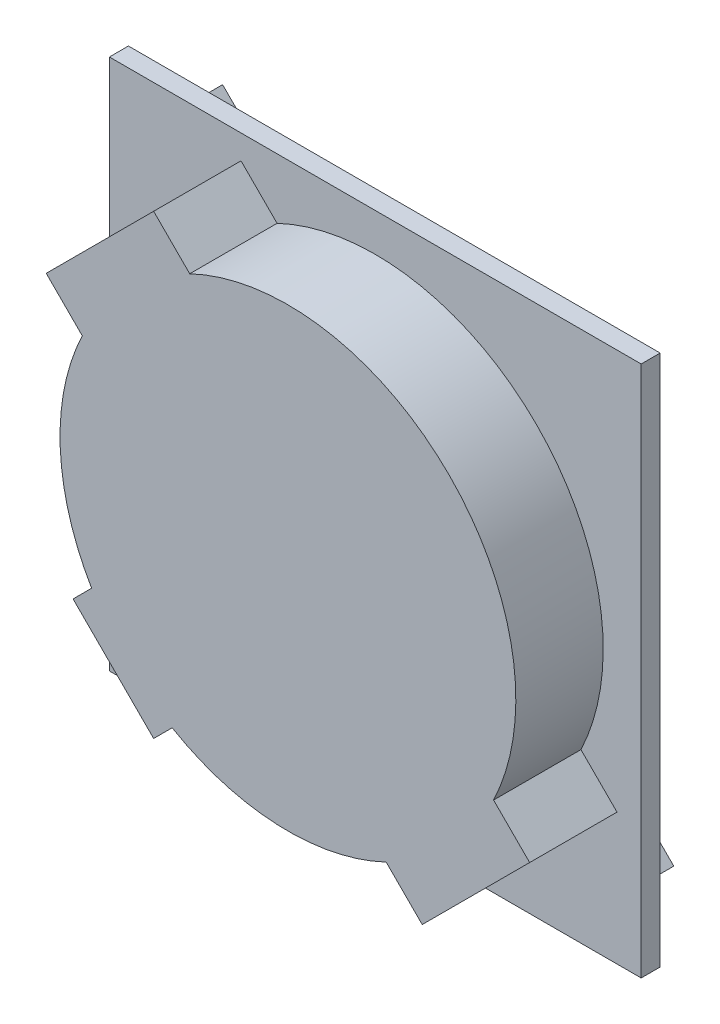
ISO-10303-21;
HEADER;
FILE_DESCRIPTION(('STEP AP214'),'2;1');
FILE_NAME('part.step','',(''),(''),'','','');
FILE_SCHEMA(('AUTOMOTIVE_DESIGN { 1 0 10303 214 1 1 1 1 }'));
ENDSEC;
DATA;
#1=APPLICATION_CONTEXT('core data for automotive mechanical design processes');
#2=APPLICATION_PROTOCOL_DEFINITION('international standard','automotive_design',2000,#1);
#3=PRODUCT_CONTEXT('',#1,'mechanical');
#4=PRODUCT('Part','Part','',(#3));
#5=PRODUCT_RELATED_PRODUCT_CATEGORY('part','',(#4));
#6=PRODUCT_DEFINITION_FORMATION('','',#4);
#7=PRODUCT_DEFINITION_CONTEXT('part definition',#1,'design');
#8=PRODUCT_DEFINITION('design','',#6,#7);
#9=PRODUCT_DEFINITION_SHAPE('','',#8);
#10=(LENGTH_UNIT() NAMED_UNIT(*) SI_UNIT(.MILLI.,.METRE.));
#11=(NAMED_UNIT(*) PLANE_ANGLE_UNIT() SI_UNIT($,.RADIAN.));
#12=(NAMED_UNIT(*) SI_UNIT($,.STERADIAN.) SOLID_ANGLE_UNIT());
#13=UNCERTAINTY_MEASURE_WITH_UNIT(LENGTH_MEASURE(1.E-05),#10,'distance_accuracy_value','');
#14=(GEOMETRIC_REPRESENTATION_CONTEXT(3) GLOBAL_UNCERTAINTY_ASSIGNED_CONTEXT((#13)) GLOBAL_UNIT_ASSIGNED_CONTEXT((#10,
#11,#12)) REPRESENTATION_CONTEXT('',''));
#15=CARTESIAN_POINT('',(0.,0.,0.));
#16=DIRECTION('',(0.,0.,1.));
#17=DIRECTION('',(1.,0.,0.));
#18=AXIS2_PLACEMENT_3D('',#15,#16,#17);
#19=CARTESIAN_POINT('',(0.,0.,0.));
#20=DIRECTION('',(0.,0.,-1.));
#21=DIRECTION('',(-1.,0.,0.));
#22=AXIS2_PLACEMENT_3D('',#19,#20,#21);
#23=PLANE('',#22);
#24=DIRECTION('',(0.707106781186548,-0.707106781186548,0.));
#25=VECTOR('',#24,1.);
#26=CARTESIAN_POINT('',(4.87867965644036,12.6568542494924,0.));
#27=LINE('',#26,#25);
#28=CARTESIAN_POINT('',(5.5857864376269,11.9497474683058,0.));
#29=VERTEX_POINT('',#28);
#30=CARTESIAN_POINT('',(7.70710678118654,9.8284271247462,0.));
#31=VERTEX_POINT('',#30);
#32=EDGE_CURVE('E410',#29,#31,#27,.T.);
#33=ORIENTED_EDGE('',*,*,#32,.F.);
#34=DIRECTION('',(1.,0.,0.));
#35=VECTOR('',#34,1.);
#36=CARTESIAN_POINT('',(5.5857864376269,11.9497474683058,0.));
#37=LINE('',#36,#35);
#38=CARTESIAN_POINT('',(4.17157287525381,11.9497474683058,0.));
#39=VERTEX_POINT('',#38);
#40=EDGE_CURVE('E663',#29,#39,#37,.F.);
#41=ORIENTED_EDGE('',*,*,#40,.T.);
#42=DIRECTION('',(0.707106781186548,0.707106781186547,0.));
#43=VECTOR('',#42,1.);
#44=CARTESIAN_POINT('',(1.34314575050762,9.12132034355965,0.));
#45=LINE('',#44,#43);
#46=CARTESIAN_POINT('',(2.05025253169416,9.82842712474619,0.));
#47=VERTEX_POINT('',#46);
#48=EDGE_CURVE('E417',#47,#39,#45,.T.);
#49=ORIENTED_EDGE('',*,*,#48,.F.);
#50=DIRECTION('',(0.,1.,0.));
#51=VECTOR('',#50,1.);
#52=CARTESIAN_POINT('',(2.05025253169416,9.82842712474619,0.));
#53=LINE('',#52,#51);
#54=CARTESIAN_POINT('',(2.05025253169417,8.4142135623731,0.));
#55=VERTEX_POINT('',#54);
#56=EDGE_CURVE('E661',#47,#55,#53,.F.);
#57=ORIENTED_EDGE('',*,*,#56,.T.);
#58=DIRECTION('',(-0.707106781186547,0.707106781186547,0.));
#59=VECTOR('',#58,1.);
#60=CARTESIAN_POINT('',(1.34314575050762,9.12132034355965,0.));
#61=LINE('',#60,#59);
#62=CARTESIAN_POINT('',(4.1715728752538,6.29289321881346,0.));
#63=VERTEX_POINT('',#62);
#64=EDGE_CURVE('E437',#63,#55,#61,.T.);
#65=ORIENTED_EDGE('',*,*,#64,.F.);
#66=DIRECTION('',(-1.,0.,0.));
#67=VECTOR('',#66,1.);
#68=CARTESIAN_POINT('',(4.1715728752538,6.29289321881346,0.));
#69=LINE('',#68,#67);
#70=CARTESIAN_POINT('',(5.5857864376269,6.29289321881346,0.));
#71=VERTEX_POINT('',#70);
#72=EDGE_CURVE('E658',#63,#71,#69,.F.);
#73=ORIENTED_EDGE('',*,*,#72,.T.);
#74=DIRECTION('',(-0.707106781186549,-0.707106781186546,0.));
#75=VECTOR('',#74,1.);
#76=CARTESIAN_POINT('',(8.41421356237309,9.12132034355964,0.));
#77=LINE('',#76,#75);
#78=CARTESIAN_POINT('',(7.70710678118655,8.4142135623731,0.));
#79=VERTEX_POINT('',#78);
#80=EDGE_CURVE('E433',#79,#71,#77,.T.);
#81=ORIENTED_EDGE('',*,*,#80,.F.);
#82=DIRECTION('',(0.,-1.,0.));
#83=VECTOR('',#82,1.);
#84=CARTESIAN_POINT('',(7.70710678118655,8.4142135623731,0.));
#85=LINE('',#84,#83);
#86=EDGE_CURVE('E60',#79,#31,#85,.F.);
#87=ORIENTED_EDGE('',*,*,#86,.T.);
#88=EDGE_LOOP('',(#33,#41,#49,#57,#65,#73,#81,#87));
#89=FACE_BOUND('',#88,.T.);
#90=DIRECTION('',(0.,-1.,0.));
#91=VECTOR('',#90,1.);
#92=CARTESIAN_POINT('',(0.,0.,0.));
#93=LINE('',#92,#91);
#94=CARTESIAN_POINT('',(0.,14.,0.));
#95=VERTEX_POINT('',#94);
#96=CARTESIAN_POINT('',(0.,0.,0.));
#97=VERTEX_POINT('',#96);
#98=EDGE_CURVE('E576',#95,#97,#93,.T.);
#99=ORIENTED_EDGE('',*,*,#98,.F.);
#100=DIRECTION('',(-1.,0.,0.));
#101=VECTOR('',#100,1.);
#102=CARTESIAN_POINT('',(0.,14.,0.));
#103=LINE('',#102,#101);
#104=CARTESIAN_POINT('',(14.,14.,0.));
#105=VERTEX_POINT('',#104);
#106=EDGE_CURVE('E582',#105,#95,#103,.T.);
#107=ORIENTED_EDGE('',*,*,#106,.F.);
#108=DIRECTION('',(0.,1.,0.));
#109=VECTOR('',#108,1.);
#110=CARTESIAN_POINT('',(14.,0.,0.));
#111=LINE('',#110,#109);
#112=CARTESIAN_POINT('',(14.,0.,0.));
#113=VERTEX_POINT('',#112);
#114=EDGE_CURVE('E598',#113,#105,#111,.T.);
#115=ORIENTED_EDGE('',*,*,#114,.F.);
#116=DIRECTION('',(1.,0.,0.));
#117=VECTOR('',#116,1.);
#118=CARTESIAN_POINT('',(0.,0.,0.));
#119=LINE('',#118,#117);
#120=EDGE_CURVE('E595',#97,#113,#119,.T.);
#121=ORIENTED_EDGE('',*,*,#120,.F.);
#122=EDGE_LOOP('',(#99,#107,#115,#121));
#123=FACE_BOUND('',#122,.T.);
#124=DIRECTION('',(-0.707106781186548,-0.707106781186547,0.));
#125=VECTOR('',#124,1.);
#126=CARTESIAN_POINT('',(2.54558441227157,13.2928932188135,0.));
#127=LINE('',#126,#125);
#128=CARTESIAN_POINT('',(2.54558441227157,13.2928932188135,0.));
#129=VERTEX_POINT('',#128);
#130=CARTESIAN_POINT('',(0.707106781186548,11.4544155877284,0.));
#131=VERTEX_POINT('',#130);
#132=EDGE_CURVE('E385',#129,#131,#127,.T.);
#133=ORIENTED_EDGE('',*,*,#132,.F.);
#134=DIRECTION('',(0.707106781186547,-0.707106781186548,0.));
#135=VECTOR('',#134,1.);
#136=CARTESIAN_POINT('',(1.97989898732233,13.8585786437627,0.));
#137=LINE('',#136,#135);
#138=CARTESIAN_POINT('',(1.97989898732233,13.8585786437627,0.));
#139=VERTEX_POINT('',#138);
#140=EDGE_CURVE('E366',#139,#129,#137,.T.);
#141=ORIENTED_EDGE('',*,*,#140,.F.);
#142=DIRECTION('',(0.707106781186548,0.707106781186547,0.));
#143=VECTOR('',#142,1.);
#144=CARTESIAN_POINT('',(0.14142135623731,12.0201010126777,0.));
#145=LINE('',#144,#143);
#146=CARTESIAN_POINT('',(0.141421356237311,12.0201010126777,0.));
#147=VERTEX_POINT('',#146);
#148=EDGE_CURVE('E372',#147,#139,#145,.T.);
#149=ORIENTED_EDGE('',*,*,#148,.F.);
#150=DIRECTION('',(-0.707106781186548,0.707106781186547,0.));
#151=VECTOR('',#150,1.);
#152=CARTESIAN_POINT('',(0.14142135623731,12.0201010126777,0.));
#153=LINE('',#152,#151);
#154=EDGE_CURVE('E388',#131,#147,#153,.T.);
#155=ORIENTED_EDGE('',*,*,#154,.F.);
#156=EDGE_LOOP('',(#133,#141,#149,#155));
#157=FACE_BOUND('',#156,.T.);
#158=DIRECTION('',(0.70710678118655,-0.707106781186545,0.));
#159=VECTOR('',#158,1.);
#160=CARTESIAN_POINT('',(0.707106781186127,2.54558441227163,0.));
#161=LINE('',#160,#159);
#162=CARTESIAN_POINT('',(0.707106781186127,2.54558441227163,0.));
#163=VERTEX_POINT('',#162);
#164=CARTESIAN_POINT('',(2.54558441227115,0.707106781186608,0.));
#165=VERTEX_POINT('',#164);
#166=EDGE_CURVE('E327',#163,#165,#161,.T.);
#167=ORIENTED_EDGE('',*,*,#166,.F.);
#168=DIRECTION('',(0.707106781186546,0.707106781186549,0.));
#169=VECTOR('',#168,1.);
#170=CARTESIAN_POINT('',(0.14142135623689,1.97989898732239,0.));
#171=LINE('',#170,#169);
#172=CARTESIAN_POINT('',(0.14142135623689,1.97989898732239,0.));
#173=VERTEX_POINT('',#172);
#174=EDGE_CURVE('E320',#173,#163,#171,.T.);
#175=ORIENTED_EDGE('',*,*,#174,.F.);
#176=DIRECTION('',(-0.70710678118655,0.707106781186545,0.));
#177=VECTOR('',#176,1.);
#178=CARTESIAN_POINT('',(1.97989898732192,0.141421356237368,0.));
#179=LINE('',#178,#177);
#180=CARTESIAN_POINT('',(1.97989898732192,0.141421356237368,0.));
#181=VERTEX_POINT('',#180);
#182=EDGE_CURVE('E337',#181,#173,#179,.T.);
#183=ORIENTED_EDGE('',*,*,#182,.F.);
#184=DIRECTION('',(-0.707106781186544,-0.707106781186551,0.));
#185=VECTOR('',#184,1.);
#186=CARTESIAN_POINT('',(1.97989898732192,0.141421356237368,0.));
#187=LINE('',#186,#185);
#188=EDGE_CURVE('E349',#165,#181,#187,.T.);
#189=ORIENTED_EDGE('',*,*,#188,.F.);
#190=EDGE_LOOP('',(#167,#175,#183,#189));
#191=FACE_BOUND('',#190,.T.);
#192=DIRECTION('',(0.707106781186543,0.707106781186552,0.));
#193=VECTOR('',#192,1.);
#194=CARTESIAN_POINT('',(11.454415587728,0.707106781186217,0.));
#195=LINE('',#194,#193);
#196=CARTESIAN_POINT('',(11.454415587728,0.707106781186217,0.));
#197=VERTEX_POINT('',#196);
#198=CARTESIAN_POINT('',(13.292893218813,2.54558441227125,0.));
#199=VERTEX_POINT('',#198);
#200=EDGE_CURVE('E1295',#197,#199,#195,.T.);
#201=ORIENTED_EDGE('',*,*,#200,.F.);
#202=DIRECTION('',(-0.707106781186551,0.707106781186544,0.));
#203=VECTOR('',#202,1.);
#204=CARTESIAN_POINT('',(12.0201010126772,0.141421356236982,0.));
#205=LINE('',#204,#203);
#206=CARTESIAN_POINT('',(12.0201010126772,0.141421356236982,0.));
#207=VERTEX_POINT('',#206);
#208=EDGE_CURVE('E317',#207,#197,#205,.T.);
#209=ORIENTED_EDGE('',*,*,#208,.F.);
#210=DIRECTION('',(-0.707106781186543,-0.707106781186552,0.));
#211=VECTOR('',#210,1.);
#212=CARTESIAN_POINT('',(13.8585786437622,1.97989898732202,0.));
#213=LINE('',#212,#211);
#214=CARTESIAN_POINT('',(13.8585786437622,1.97989898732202,0.));
#215=VERTEX_POINT('',#214);
#216=EDGE_CURVE('E313',#215,#207,#213,.T.);
#217=ORIENTED_EDGE('',*,*,#216,.F.);
#218=DIRECTION('',(0.707106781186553,-0.707106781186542,0.));
#219=VECTOR('',#218,1.);
#220=CARTESIAN_POINT('',(13.8585786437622,1.97989898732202,0.));
#221=LINE('',#220,#219);
#222=EDGE_CURVE('E1291',#199,#215,#221,.T.);
#223=ORIENTED_EDGE('',*,*,#222,.F.);
#224=EDGE_LOOP('',(#201,#209,#217,#223));
#225=FACE_BOUND('',#224,.T.);
#226=ADVANCED_FACE('F55',(#89,#123,#157,#191,#225),#23,.T.);
#227=CARTESIAN_POINT('',(0.,0.,0.5));
#228=DIRECTION('',(0.,0.,-1.));
#229=DIRECTION('',(-1.,0.,0.));
#230=AXIS2_PLACEMENT_3D('',#227,#228,#229);
#231=PLANE('',#230);
#232=DIRECTION('',(0.,-1.,0.));
#233=VECTOR('',#232,1.);
#234=CARTESIAN_POINT('',(0.,0.,0.5));
#235=LINE('',#234,#233);
#236=CARTESIAN_POINT('',(0.,14.,0.5));
#237=VERTEX_POINT('',#236);
#238=CARTESIAN_POINT('',(0.,0.,0.5));
#239=VERTEX_POINT('',#238);
#240=EDGE_CURVE('E577',#237,#239,#235,.T.);
#241=ORIENTED_EDGE('',*,*,#240,.T.);
#242=DIRECTION('',(1.,0.,0.));
#243=VECTOR('',#242,1.);
#244=CARTESIAN_POINT('',(0.,0.,0.5));
#245=LINE('',#244,#243);
#246=CARTESIAN_POINT('',(14.,0.,0.5));
#247=VERTEX_POINT('',#246);
#248=EDGE_CURVE('E581',#239,#247,#245,.T.);
#249=ORIENTED_EDGE('',*,*,#248,.T.);
#250=DIRECTION('',(0.,1.,0.));
#251=VECTOR('',#250,1.);
#252=CARTESIAN_POINT('',(14.,0.,0.5));
#253=LINE('',#252,#251);
#254=CARTESIAN_POINT('',(14.,14.,0.5));
#255=VERTEX_POINT('',#254);
#256=EDGE_CURVE('E585',#247,#255,#253,.T.);
#257=ORIENTED_EDGE('',*,*,#256,.T.);
#258=DIRECTION('',(-1.,0.,0.));
#259=VECTOR('',#258,1.);
#260=CARTESIAN_POINT('',(0.,14.,0.5));
#261=LINE('',#260,#259);
#262=EDGE_CURVE('E588',#255,#237,#261,.T.);
#263=ORIENTED_EDGE('',*,*,#262,.T.);
#264=EDGE_LOOP('',(#241,#249,#257,#263));
#265=FACE_BOUND('',#264,.T.);
#266=CARTESIAN_POINT('',(7.,7.,0.5));
#267=DIRECTION('',(0.,0.,1.));
#268=DIRECTION('',(1.,0.,0.));
#269=AXIS2_PLACEMENT_3D('',#266,#267,#268);
#270=CIRCLE('',#269,6.);
#271=CARTESIAN_POINT('',(3.95274099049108,1.83142064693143,0.5));
#272=VERTEX_POINT('',#271);
#273=CARTESIAN_POINT('',(9.58578643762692,1.58578643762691,0.5));
#274=VERTEX_POINT('',#273);
#275=EDGE_CURVE('E429',#272,#274,#270,.T.);
#276=ORIENTED_EDGE('',*,*,#275,.F.);
#277=DIRECTION('',(0.707106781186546,0.707106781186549,0.));
#278=VECTOR('',#277,1.);
#279=CARTESIAN_POINT('',(3.95274099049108,1.83142064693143,0.5));
#280=LINE('',#279,#278);
#281=CARTESIAN_POINT('',(3.46446609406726,1.34314575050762,0.5));
#282=VERTEX_POINT('',#281);
#283=EDGE_CURVE('E449',#282,#272,#280,.T.);
#284=ORIENTED_EDGE('',*,*,#283,.F.);
#285=DIRECTION('',(0.707106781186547,-0.707106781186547,0.));
#286=VECTOR('',#285,1.);
#287=CARTESIAN_POINT('',(1.34314575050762,3.46446609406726,0.5));
#288=LINE('',#287,#286);
#289=CARTESIAN_POINT('',(1.34314575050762,3.46446609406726,0.5));
#290=VERTEX_POINT('',#289);
#291=EDGE_CURVE('E522',#290,#282,#288,.T.);
#292=ORIENTED_EDGE('',*,*,#291,.F.);
#293=DIRECTION('',(-0.707106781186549,-0.707106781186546,0.));
#294=VECTOR('',#293,1.);
#295=CARTESIAN_POINT('',(1.83142064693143,3.95274099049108,0.5));
#296=LINE('',#295,#294);
#297=CARTESIAN_POINT('',(1.83142064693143,3.95274099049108,0.5));
#298=VERTEX_POINT('',#297);
#299=EDGE_CURVE('E518',#298,#290,#296,.T.);
#300=ORIENTED_EDGE('',*,*,#299,.F.);
#301=CARTESIAN_POINT('',(7.,7.,0.5));
#302=DIRECTION('',(0.,0.,1.));
#303=DIRECTION('',(1.,0.,0.));
#304=AXIS2_PLACEMENT_3D('',#301,#302,#303);
#305=CIRCLE('',#304,6.);
#306=CARTESIAN_POINT('',(1.58578643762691,9.58578643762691,0.5));
#307=VERTEX_POINT('',#306);
#308=EDGE_CURVE('E514',#307,#298,#305,.T.);
#309=ORIENTED_EDGE('',*,*,#308,.F.);
#310=DIRECTION('',(0.707106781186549,-0.707106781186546,0.));
#311=VECTOR('',#310,1.);
#312=CARTESIAN_POINT('',(0.63603896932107,10.5355339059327,0.5));
#313=LINE('',#312,#311);
#314=CARTESIAN_POINT('',(0.63603896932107,10.5355339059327,0.5));
#315=VERTEX_POINT('',#314);
#316=EDGE_CURVE('E510',#315,#307,#313,.T.);
#317=ORIENTED_EDGE('',*,*,#316,.F.);
#318=DIRECTION('',(-0.707106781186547,-0.707106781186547,0.));
#319=VECTOR('',#318,1.);
#320=CARTESIAN_POINT('',(3.46446609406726,13.3639610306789,0.5));
#321=LINE('',#320,#319);
#322=CARTESIAN_POINT('',(3.46446609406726,13.3639610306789,0.5));
#323=VERTEX_POINT('',#322);
#324=EDGE_CURVE('E506',#323,#315,#321,.T.);
#325=ORIENTED_EDGE('',*,*,#324,.F.);
#326=DIRECTION('',(-0.707106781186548,0.707106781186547,0.));
#327=VECTOR('',#326,1.);
#328=CARTESIAN_POINT('',(3.46446609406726,13.3639610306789,0.5));
#329=LINE('',#328,#327);
#330=CARTESIAN_POINT('',(4.41421356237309,12.4142135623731,0.5));
#331=VERTEX_POINT('',#330);
#332=EDGE_CURVE('E502',#331,#323,#329,.T.);
#333=ORIENTED_EDGE('',*,*,#332,.F.);
#334=CARTESIAN_POINT('',(7.,7.,0.5));
#335=DIRECTION('',(0.,0.,1.));
#336=DIRECTION('',(1.,0.,0.));
#337=AXIS2_PLACEMENT_3D('',#334,#335,#336);
#338=CIRCLE('',#337,6.);
#339=CARTESIAN_POINT('',(12.4142135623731,4.4142135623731,0.5));
#340=VERTEX_POINT('',#339);
#341=EDGE_CURVE('E498',#340,#331,#338,.T.);
#342=ORIENTED_EDGE('',*,*,#341,.F.);
#343=DIRECTION('',(-0.707106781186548,0.707106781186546,0.));
#344=VECTOR('',#343,1.);
#345=CARTESIAN_POINT('',(12.4142135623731,4.4142135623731,0.5));
#346=LINE('',#345,#344);
#347=CARTESIAN_POINT('',(13.3639610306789,3.46446609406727,0.5));
#348=VERTEX_POINT('',#347);
#349=EDGE_CURVE('E494',#348,#340,#346,.T.);
#350=ORIENTED_EDGE('',*,*,#349,.F.);
#351=DIRECTION('',(0.707106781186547,0.707106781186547,0.));
#352=VECTOR('',#351,1.);
#353=CARTESIAN_POINT('',(13.3639610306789,3.46446609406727,0.5));
#354=LINE('',#353,#352);
#355=CARTESIAN_POINT('',(10.5355339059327,0.636038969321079,0.5));
#356=VERTEX_POINT('',#355);
#357=EDGE_CURVE('E490',#356,#348,#354,.T.);
#358=ORIENTED_EDGE('',*,*,#357,.F.);
#359=DIRECTION('',(0.707106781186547,-0.707106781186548,0.));
#360=VECTOR('',#359,1.);
#361=CARTESIAN_POINT('',(9.58578643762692,1.58578643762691,0.5));
#362=LINE('',#361,#360);
#363=EDGE_CURVE('E486',#274,#356,#362,.T.);
#364=ORIENTED_EDGE('',*,*,#363,.F.);
#365=EDGE_LOOP('',(#276,#284,#292,#300,#309,#317,#325,#333,#342,#350,#358,#364));
#366=FACE_BOUND('',#365,.T.);
#367=ADVANCED_FACE('F718',(#265,#366),#231,.F.);
#368=CARTESIAN_POINT('',(0.,0.,0.5));
#369=DIRECTION('',(1.,0.,0.));
#370=DIRECTION('',(0.,0.,-1.));
#371=AXIS2_PLACEMENT_3D('',#368,#369,#370);
#372=PLANE('',#371);
#373=ORIENTED_EDGE('',*,*,#98,.T.);
#374=DIRECTION('',(0.,0.,-1.));
#375=VECTOR('',#374,1.);
#376=CARTESIAN_POINT('',(0.,0.,0.5));
#377=LINE('',#376,#375);
#378=EDGE_CURVE('E614',#239,#97,#377,.T.);
#379=ORIENTED_EDGE('',*,*,#378,.F.);
#380=ORIENTED_EDGE('',*,*,#240,.F.);
#381=DIRECTION('',(0.,0.,-1.));
#382=VECTOR('',#381,1.);
#383=CARTESIAN_POINT('',(0.,14.,0.5));
#384=LINE('',#383,#382);
#385=EDGE_CURVE('E591',#237,#95,#384,.T.);
#386=ORIENTED_EDGE('',*,*,#385,.T.);
#387=EDGE_LOOP('',(#373,#379,#380,#386));
#388=FACE_BOUND('',#387,.T.);
#389=ADVANCED_FACE('F723',(#388),#372,.F.);
#390=CARTESIAN_POINT('',(0.,0.,0.5));
#391=DIRECTION('',(0.,1.,0.));
#392=DIRECTION('',(0.,0.,1.));
#393=AXIS2_PLACEMENT_3D('',#390,#391,#392);
#394=PLANE('',#393);
#395=ORIENTED_EDGE('',*,*,#120,.T.);
#396=DIRECTION('',(0.,0.,-1.));
#397=VECTOR('',#396,1.);
#398=CARTESIAN_POINT('',(14.,0.,0.5));
#399=LINE('',#398,#397);
#400=EDGE_CURVE('E610',#247,#113,#399,.T.);
#401=ORIENTED_EDGE('',*,*,#400,.F.);
#402=ORIENTED_EDGE('',*,*,#248,.F.);
#403=ORIENTED_EDGE('',*,*,#378,.T.);
#404=EDGE_LOOP('',(#395,#401,#402,#403));
#405=FACE_BOUND('',#404,.T.);
#406=ADVANCED_FACE('F736',(#405),#394,.F.);
#407=CARTESIAN_POINT('',(14.,0.,0.5));
#408=DIRECTION('',(-1.,0.,0.));
#409=DIRECTION('',(0.,0.,1.));
#410=AXIS2_PLACEMENT_3D('',#407,#408,#409);
#411=PLANE('',#410);
#412=ORIENTED_EDGE('',*,*,#114,.T.);
#413=DIRECTION('',(0.,0.,-1.));
#414=VECTOR('',#413,1.);
#415=CARTESIAN_POINT('',(14.,14.,0.5));
#416=LINE('',#415,#414);
#417=EDGE_CURVE('E606',#255,#105,#416,.T.);
#418=ORIENTED_EDGE('',*,*,#417,.F.);
#419=ORIENTED_EDGE('',*,*,#256,.F.);
#420=ORIENTED_EDGE('',*,*,#400,.T.);
#421=EDGE_LOOP('',(#412,#418,#419,#420));
#422=FACE_BOUND('',#421,.T.);
#423=ADVANCED_FACE('F732',(#422),#411,.F.);
#424=CARTESIAN_POINT('',(0.,14.,0.5));
#425=DIRECTION('',(0.,-1.,0.));
#426=DIRECTION('',(0.,0.,-1.));
#427=AXIS2_PLACEMENT_3D('',#424,#425,#426);
#428=PLANE('',#427);
#429=ORIENTED_EDGE('',*,*,#106,.T.);
#430=ORIENTED_EDGE('',*,*,#385,.F.);
#431=ORIENTED_EDGE('',*,*,#262,.F.);
#432=ORIENTED_EDGE('',*,*,#417,.T.);
#433=EDGE_LOOP('',(#429,#430,#431,#432));
#434=FACE_BOUND('',#433,.T.);
#435=ADVANCED_FACE('F728',(#434),#428,.F.);
#436=CARTESIAN_POINT('',(7.,7.,2.8));
#437=DIRECTION('',(0.,0.,-1.));
#438=DIRECTION('',(-1.,0.,0.));
#439=AXIS2_PLACEMENT_3D('',#436,#437,#438);
#440=CYLINDRICAL_SURFACE('',#439,6.);
#441=ORIENTED_EDGE('',*,*,#275,.T.);
#442=DIRECTION('',(0.,0.,-1.));
#443=VECTOR('',#442,1.);
#444=CARTESIAN_POINT('',(9.58578643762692,1.58578643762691,2.8));
#445=LINE('',#444,#443);
#446=CARTESIAN_POINT('',(9.58578643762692,1.58578643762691,2.8));
#447=VERTEX_POINT('',#446);
#448=EDGE_CURVE('E572',#447,#274,#445,.T.);
#449=ORIENTED_EDGE('',*,*,#448,.F.);
#450=CARTESIAN_POINT('',(7.,7.,2.8));
#451=DIRECTION('',(0.,0.,1.));
#452=DIRECTION('',(1.,0.,0.));
#453=AXIS2_PLACEMENT_3D('',#450,#451,#452);
#454=CIRCLE('',#453,6.);
#455=CARTESIAN_POINT('',(3.95274099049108,1.83142064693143,2.8));
#456=VERTEX_POINT('',#455);
#457=EDGE_CURVE('E444',#456,#447,#454,.T.);
#458=ORIENTED_EDGE('',*,*,#457,.F.);
#459=DIRECTION('',(0.,0.,-1.));
#460=VECTOR('',#459,1.);
#461=CARTESIAN_POINT('',(3.95274099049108,1.83142064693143,2.8));
#462=LINE('',#461,#460);
#463=EDGE_CURVE('E482',#456,#272,#462,.T.);
#464=ORIENTED_EDGE('',*,*,#463,.T.);
#465=EDGE_LOOP('',(#441,#449,#458,#464));
#466=FACE_BOUND('',#465,.T.);
#467=ADVANCED_FACE('F731',(#466),#440,.T.);
#468=CARTESIAN_POINT('',(9.58578643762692,1.58578643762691,2.8));
#469=DIRECTION('',(0.707106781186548,0.707106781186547,0.));
#470=DIRECTION('',(-0.707106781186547,0.707106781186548,0.));
#471=AXIS2_PLACEMENT_3D('',#468,#469,#470);
#472=PLANE('',#471);
#473=ORIENTED_EDGE('',*,*,#363,.T.);
#474=DIRECTION('',(0.,0.,-1.));
#475=VECTOR('',#474,1.);
#476=CARTESIAN_POINT('',(10.5355339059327,0.636038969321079,2.8));
#477=LINE('',#476,#475);
#478=CARTESIAN_POINT('',(10.5355339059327,0.636038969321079,2.8));
#479=VERTEX_POINT('',#478);
#480=EDGE_CURVE('E568',#479,#356,#477,.T.);
#481=ORIENTED_EDGE('',*,*,#480,.F.);
#482=DIRECTION('',(0.707106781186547,-0.707106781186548,0.));
#483=VECTOR('',#482,1.);
#484=CARTESIAN_POINT('',(9.58578643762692,1.58578643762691,2.8));
#485=LINE('',#484,#483);
#486=EDGE_CURVE('E448',#447,#479,#485,.T.);
#487=ORIENTED_EDGE('',*,*,#486,.F.);
#488=ORIENTED_EDGE('',*,*,#448,.T.);
#489=EDGE_LOOP('',(#473,#481,#487,#488));
#490=FACE_BOUND('',#489,.T.);
#491=ADVANCED_FACE('F817',(#490),#472,.F.);
#492=CARTESIAN_POINT('',(13.3639610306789,3.46446609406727,2.8));
#493=DIRECTION('',(-0.707106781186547,0.707106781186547,0.));
#494=DIRECTION('',(-0.707106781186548,-0.707106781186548,0.));
#495=AXIS2_PLACEMENT_3D('',#492,#493,#494);
#496=PLANE('',#495);
#497=ORIENTED_EDGE('',*,*,#357,.T.);
#498=DIRECTION('',(0.,0.,-1.));
#499=VECTOR('',#498,1.);
#500=CARTESIAN_POINT('',(13.3639610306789,3.46446609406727,2.8));
#501=LINE('',#500,#499);
#502=CARTESIAN_POINT('',(13.3639610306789,3.46446609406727,2.8));
#503=VERTEX_POINT('',#502);
#504=EDGE_CURVE('E564',#503,#348,#501,.T.);
#505=ORIENTED_EDGE('',*,*,#504,.F.);
#506=DIRECTION('',(0.707106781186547,0.707106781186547,0.));
#507=VECTOR('',#506,1.);
#508=CARTESIAN_POINT('',(13.3639610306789,3.46446609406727,2.8));
#509=LINE('',#508,#507);
#510=EDGE_CURVE('E452',#479,#503,#509,.T.);
#511=ORIENTED_EDGE('',*,*,#510,.F.);
#512=ORIENTED_EDGE('',*,*,#480,.T.);
#513=EDGE_LOOP('',(#497,#505,#511,#512));
#514=FACE_BOUND('',#513,.T.);
#515=ADVANCED_FACE('F813',(#514),#496,.F.);
#516=CARTESIAN_POINT('',(12.4142135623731,4.4142135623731,2.8));
#517=DIRECTION('',(-0.707106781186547,-0.707106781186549,0.));
#518=DIRECTION('',(0.707106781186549,-0.707106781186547,0.));
#519=AXIS2_PLACEMENT_3D('',#516,#517,#518);
#520=PLANE('',#519);
#521=ORIENTED_EDGE('',*,*,#349,.T.);
#522=DIRECTION('',(0.,0.,-1.));
#523=VECTOR('',#522,1.);
#524=CARTESIAN_POINT('',(12.4142135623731,4.4142135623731,2.8));
#525=LINE('',#524,#523);
#526=CARTESIAN_POINT('',(12.4142135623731,4.4142135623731,2.8));
#527=VERTEX_POINT('',#526);
#528=EDGE_CURVE('E560',#527,#340,#525,.T.);
#529=ORIENTED_EDGE('',*,*,#528,.F.);
#530=DIRECTION('',(-0.707106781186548,0.707106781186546,0.));
#531=VECTOR('',#530,1.);
#532=CARTESIAN_POINT('',(12.4142135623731,4.4142135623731,2.8));
#533=LINE('',#532,#531);
#534=EDGE_CURVE('E455',#503,#527,#533,.T.);
#535=ORIENTED_EDGE('',*,*,#534,.F.);
#536=ORIENTED_EDGE('',*,*,#504,.T.);
#537=EDGE_LOOP('',(#521,#529,#535,#536));
#538=FACE_BOUND('',#537,.T.);
#539=ADVANCED_FACE('F809',(#538),#520,.F.);
#540=CARTESIAN_POINT('',(7.,7.,2.8));
#541=DIRECTION('',(0.,0.,-1.));
#542=DIRECTION('',(-1.,0.,0.));
#543=AXIS2_PLACEMENT_3D('',#540,#541,#542);
#544=CYLINDRICAL_SURFACE('',#543,6.);
#545=ORIENTED_EDGE('',*,*,#341,.T.);
#546=DIRECTION('',(0.,0.,-1.));
#547=VECTOR('',#546,1.);
#548=CARTESIAN_POINT('',(4.41421356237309,12.4142135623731,2.8));
#549=LINE('',#548,#547);
#550=CARTESIAN_POINT('',(4.41421356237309,12.4142135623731,2.8));
#551=VERTEX_POINT('',#550);
#552=EDGE_CURVE('E556',#551,#331,#549,.T.);
#553=ORIENTED_EDGE('',*,*,#552,.F.);
#554=CARTESIAN_POINT('',(7.,7.,2.8));
#555=DIRECTION('',(0.,0.,1.));
#556=DIRECTION('',(1.,0.,0.));
#557=AXIS2_PLACEMENT_3D('',#554,#555,#556);
#558=CIRCLE('',#557,6.);
#559=EDGE_CURVE('E458',#527,#551,#558,.T.);
#560=ORIENTED_EDGE('',*,*,#559,.F.);
#561=ORIENTED_EDGE('',*,*,#528,.T.);
#562=EDGE_LOOP('',(#545,#553,#560,#561));
#563=FACE_BOUND('',#562,.T.);
#564=ADVANCED_FACE('F805',(#563),#544,.T.);
#565=CARTESIAN_POINT('',(3.46446609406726,13.3639610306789,2.8));
#566=DIRECTION('',(-0.707106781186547,-0.707106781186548,0.));
#567=DIRECTION('',(0.707106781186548,-0.707106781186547,0.));
#568=AXIS2_PLACEMENT_3D('',#565,#566,#567);
#569=PLANE('',#568);
#570=ORIENTED_EDGE('',*,*,#332,.T.);
#571=DIRECTION('',(0.,0.,-1.));
#572=VECTOR('',#571,1.);
#573=CARTESIAN_POINT('',(3.46446609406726,13.3639610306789,2.8));
#574=LINE('',#573,#572);
#575=CARTESIAN_POINT('',(3.46446609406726,13.3639610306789,2.8));
#576=VERTEX_POINT('',#575);
#577=EDGE_CURVE('E552',#576,#323,#574,.T.);
#578=ORIENTED_EDGE('',*,*,#577,.F.);
#579=DIRECTION('',(-0.707106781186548,0.707106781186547,0.));
#580=VECTOR('',#579,1.);
#581=CARTESIAN_POINT('',(3.46446609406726,13.3639610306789,2.8));
#582=LINE('',#581,#580);
#583=EDGE_CURVE('E461',#551,#576,#582,.T.);
#584=ORIENTED_EDGE('',*,*,#583,.F.);
#585=ORIENTED_EDGE('',*,*,#552,.T.);
#586=EDGE_LOOP('',(#570,#578,#584,#585));
#587=FACE_BOUND('',#586,.T.);
#588=ADVANCED_FACE('F801',(#587),#569,.F.);
#589=CARTESIAN_POINT('',(3.46446609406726,13.3639610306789,2.8));
#590=DIRECTION('',(0.707106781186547,-0.707106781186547,0.));
#591=DIRECTION('',(0.707106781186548,0.707106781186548,0.));
#592=AXIS2_PLACEMENT_3D('',#589,#590,#591);
#593=PLANE('',#592);
#594=ORIENTED_EDGE('',*,*,#324,.T.);
#595=DIRECTION('',(0.,0.,-1.));
#596=VECTOR('',#595,1.);
#597=CARTESIAN_POINT('',(0.63603896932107,10.5355339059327,2.8));
#598=LINE('',#597,#596);
#599=CARTESIAN_POINT('',(0.63603896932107,10.5355339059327,2.8));
#600=VERTEX_POINT('',#599);
#601=EDGE_CURVE('E548',#600,#315,#598,.T.);
#602=ORIENTED_EDGE('',*,*,#601,.F.);
#603=DIRECTION('',(-0.707106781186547,-0.707106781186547,0.));
#604=VECTOR('',#603,1.);
#605=CARTESIAN_POINT('',(3.46446609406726,13.3639610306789,2.8));
#606=LINE('',#605,#604);
#607=EDGE_CURVE('E464',#576,#600,#606,.T.);
#608=ORIENTED_EDGE('',*,*,#607,.F.);
#609=ORIENTED_EDGE('',*,*,#577,.T.);
#610=EDGE_LOOP('',(#594,#602,#608,#609));
#611=FACE_BOUND('',#610,.T.);
#612=ADVANCED_FACE('F797',(#611),#593,.F.);
#613=CARTESIAN_POINT('',(0.63603896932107,10.5355339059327,2.8));
#614=DIRECTION('',(0.707106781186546,0.707106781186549,0.));
#615=DIRECTION('',(-0.707106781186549,0.707106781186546,0.));
#616=AXIS2_PLACEMENT_3D('',#613,#614,#615);
#617=PLANE('',#616);
#618=ORIENTED_EDGE('',*,*,#316,.T.);
#619=DIRECTION('',(0.,0.,-1.));
#620=VECTOR('',#619,1.);
#621=CARTESIAN_POINT('',(1.58578643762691,9.58578643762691,2.8));
#622=LINE('',#621,#620);
#623=CARTESIAN_POINT('',(1.58578643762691,9.58578643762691,2.8));
#624=VERTEX_POINT('',#623);
#625=EDGE_CURVE('E544',#624,#307,#622,.T.);
#626=ORIENTED_EDGE('',*,*,#625,.F.);
#627=DIRECTION('',(0.707106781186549,-0.707106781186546,0.));
#628=VECTOR('',#627,1.);
#629=CARTESIAN_POINT('',(0.63603896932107,10.5355339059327,2.8));
#630=LINE('',#629,#628);
#631=EDGE_CURVE('E467',#600,#624,#630,.T.);
#632=ORIENTED_EDGE('',*,*,#631,.F.);
#633=ORIENTED_EDGE('',*,*,#601,.T.);
#634=EDGE_LOOP('',(#618,#626,#632,#633));
#635=FACE_BOUND('',#634,.T.);
#636=ADVANCED_FACE('F793',(#635),#617,.F.);
#637=CARTESIAN_POINT('',(7.,7.,2.8));
#638=DIRECTION('',(0.,0.,-1.));
#639=DIRECTION('',(-1.,0.,0.));
#640=AXIS2_PLACEMENT_3D('',#637,#638,#639);
#641=CYLINDRICAL_SURFACE('',#640,6.);
#642=ORIENTED_EDGE('',*,*,#308,.T.);
#643=DIRECTION('',(0.,0.,-1.));
#644=VECTOR('',#643,1.);
#645=CARTESIAN_POINT('',(1.83142064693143,3.95274099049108,2.8));
#646=LINE('',#645,#644);
#647=CARTESIAN_POINT('',(1.83142064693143,3.95274099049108,2.8));
#648=VERTEX_POINT('',#647);
#649=EDGE_CURVE('E540',#648,#298,#646,.T.);
#650=ORIENTED_EDGE('',*,*,#649,.F.);
#651=CARTESIAN_POINT('',(7.,7.,2.8));
#652=DIRECTION('',(0.,0.,1.));
#653=DIRECTION('',(1.,0.,0.));
#654=AXIS2_PLACEMENT_3D('',#651,#652,#653);
#655=CIRCLE('',#654,6.);
#656=EDGE_CURVE('E470',#624,#648,#655,.T.);
#657=ORIENTED_EDGE('',*,*,#656,.F.);
#658=ORIENTED_EDGE('',*,*,#625,.T.);
#659=EDGE_LOOP('',(#642,#650,#657,#658));
#660=FACE_BOUND('',#659,.T.);
#661=ADVANCED_FACE('F789',(#660),#641,.T.);
#662=CARTESIAN_POINT('',(1.83142064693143,3.95274099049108,2.8));
#663=DIRECTION('',(0.707106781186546,-0.707106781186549,0.));
#664=DIRECTION('',(0.707106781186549,0.707106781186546,0.));
#665=AXIS2_PLACEMENT_3D('',#662,#663,#664);
#666=PLANE('',#665);
#667=ORIENTED_EDGE('',*,*,#299,.T.);
#668=DIRECTION('',(0.,0.,-1.));
#669=VECTOR('',#668,1.);
#670=CARTESIAN_POINT('',(1.34314575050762,3.46446609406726,2.8));
#671=LINE('',#670,#669);
#672=CARTESIAN_POINT('',(1.34314575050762,3.46446609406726,2.8));
#673=VERTEX_POINT('',#672);
#674=EDGE_CURVE('E536',#673,#290,#671,.T.);
#675=ORIENTED_EDGE('',*,*,#674,.F.);
#676=DIRECTION('',(-0.707106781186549,-0.707106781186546,0.));
#677=VECTOR('',#676,1.);
#678=CARTESIAN_POINT('',(1.83142064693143,3.95274099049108,2.8));
#679=LINE('',#678,#677);
#680=EDGE_CURVE('E473',#648,#673,#679,.T.);
#681=ORIENTED_EDGE('',*,*,#680,.F.);
#682=ORIENTED_EDGE('',*,*,#649,.T.);
#683=EDGE_LOOP('',(#667,#675,#681,#682));
#684=FACE_BOUND('',#683,.T.);
#685=ADVANCED_FACE('F785',(#684),#666,.F.);
#686=CARTESIAN_POINT('',(1.34314575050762,3.46446609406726,2.8));
#687=DIRECTION('',(0.707106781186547,0.707106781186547,0.));
#688=DIRECTION('',(-0.707106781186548,0.707106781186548,0.));
#689=AXIS2_PLACEMENT_3D('',#686,#687,#688);
#690=PLANE('',#689);
#691=ORIENTED_EDGE('',*,*,#291,.T.);
#692=DIRECTION('',(0.,0.,-1.));
#693=VECTOR('',#692,1.);
#694=CARTESIAN_POINT('',(3.46446609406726,1.34314575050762,2.8));
#695=LINE('',#694,#693);
#696=CARTESIAN_POINT('',(3.46446609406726,1.34314575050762,2.8));
#697=VERTEX_POINT('',#696);
#698=EDGE_CURVE('E532',#697,#282,#695,.T.);
#699=ORIENTED_EDGE('',*,*,#698,.F.);
#700=DIRECTION('',(0.707106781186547,-0.707106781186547,0.));
#701=VECTOR('',#700,1.);
#702=CARTESIAN_POINT('',(1.34314575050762,3.46446609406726,2.8));
#703=LINE('',#702,#701);
#704=EDGE_CURVE('E476',#673,#697,#703,.T.);
#705=ORIENTED_EDGE('',*,*,#704,.F.);
#706=ORIENTED_EDGE('',*,*,#674,.T.);
#707=EDGE_LOOP('',(#691,#699,#705,#706));
#708=FACE_BOUND('',#707,.T.);
#709=ADVANCED_FACE('F781',(#708),#690,.F.);
#710=CARTESIAN_POINT('',(3.95274099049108,1.83142064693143,2.8));
#711=DIRECTION('',(-0.707106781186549,0.707106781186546,0.));
#712=DIRECTION('',(-0.707106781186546,-0.707106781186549,0.));
#713=AXIS2_PLACEMENT_3D('',#710,#711,#712);
#714=PLANE('',#713);
#715=ORIENTED_EDGE('',*,*,#283,.T.);
#716=ORIENTED_EDGE('',*,*,#463,.F.);
#717=DIRECTION('',(0.707106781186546,0.707106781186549,0.));
#718=VECTOR('',#717,1.);
#719=CARTESIAN_POINT('',(3.95274099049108,1.83142064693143,2.8));
#720=LINE('',#719,#718);
#721=EDGE_CURVE('E479',#697,#456,#720,.T.);
#722=ORIENTED_EDGE('',*,*,#721,.F.);
#723=ORIENTED_EDGE('',*,*,#698,.T.);
#724=EDGE_LOOP('',(#715,#716,#722,#723));
#725=FACE_BOUND('',#724,.T.);
#726=ADVANCED_FACE('F777',(#725),#714,.F.);
#727=CARTESIAN_POINT('',(7.,7.,2.8));
#728=DIRECTION('',(0.,0.,1.));
#729=DIRECTION('',(1.,0.,0.));
#730=AXIS2_PLACEMENT_3D('',#727,#728,#729);
#731=PLANE('',#730);
#732=ORIENTED_EDGE('',*,*,#457,.T.);
#733=ORIENTED_EDGE('',*,*,#486,.T.);
#734=ORIENTED_EDGE('',*,*,#510,.T.);
#735=ORIENTED_EDGE('',*,*,#534,.T.);
#736=ORIENTED_EDGE('',*,*,#559,.T.);
#737=ORIENTED_EDGE('',*,*,#583,.T.);
#738=ORIENTED_EDGE('',*,*,#607,.T.);
#739=ORIENTED_EDGE('',*,*,#631,.T.);
#740=ORIENTED_EDGE('',*,*,#656,.T.);
#741=ORIENTED_EDGE('',*,*,#680,.T.);
#742=ORIENTED_EDGE('',*,*,#704,.T.);
#743=ORIENTED_EDGE('',*,*,#721,.T.);
#744=EDGE_LOOP('',(#732,#733,#734,#735,#736,#737,#738,#739,#740,#741,#742,#743));
#745=FACE_BOUND('',#744,.T.);
#746=ADVANCED_FACE('F774',(#745),#731,.T.);
#747=CARTESIAN_POINT('',(4.87867965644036,12.6568542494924,-1.));
#748=DIRECTION('',(-0.707106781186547,-0.707106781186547,0.));
#749=DIRECTION('',(0.707106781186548,-0.707106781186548,0.));
#750=AXIS2_PLACEMENT_3D('',#747,#748,#749);
#751=PLANE('',#750);
#752=DIRECTION('',(0.707106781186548,-0.707106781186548,0.));
#753=VECTOR('',#752,1.);
#754=CARTESIAN_POINT('',(4.87867965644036,12.6568542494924,-1.));
#755=LINE('',#754,#753);
#756=CARTESIAN_POINT('',(5.5857864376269,11.9497474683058,-1.));
#757=VERTEX_POINT('',#756);
#758=CARTESIAN_POINT('',(7.70710678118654,9.8284271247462,-1.));
#759=VERTEX_POINT('',#758);
#760=EDGE_CURVE('E412',#757,#759,#755,.T.);
#761=ORIENTED_EDGE('',*,*,#760,.F.);
#762=DIRECTION('',(0.,0.,1.));
#763=VECTOR('',#762,1.);
#764=CARTESIAN_POINT('',(5.5857864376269,11.9497474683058,-1.));
#765=LINE('',#764,#763);
#766=EDGE_CURVE('E654',#757,#29,#765,.T.);
#767=ORIENTED_EDGE('',*,*,#766,.T.);
#768=ORIENTED_EDGE('',*,*,#32,.T.);
#769=DIRECTION('',(0.,0.,-1.));
#770=VECTOR('',#769,1.);
#771=CARTESIAN_POINT('',(7.70710678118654,9.8284271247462,-1.));
#772=LINE('',#771,#770);
#773=EDGE_CURVE('E651',#31,#759,#772,.T.);
#774=ORIENTED_EDGE('',*,*,#773,.T.);
#775=EDGE_LOOP('',(#761,#767,#768,#774));
#776=FACE_BOUND('',#775,.T.);
#777=ADVANCED_FACE('F680',(#776),#751,.F.);
#778=CARTESIAN_POINT('',(8.41421356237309,9.12132034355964,-1.));
#779=DIRECTION('',(-0.707106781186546,0.707106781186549,0.));
#780=DIRECTION('',(-0.707106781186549,-0.707106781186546,0.));
#781=AXIS2_PLACEMENT_3D('',#778,#779,#780);
#782=PLANE('',#781);
#783=ORIENTED_EDGE('',*,*,#80,.T.);
#784=DIRECTION('',(0.,0.,-1.));
#785=VECTOR('',#784,1.);
#786=CARTESIAN_POINT('',(5.5857864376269,6.29289321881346,-1.));
#787=LINE('',#786,#785);
#788=CARTESIAN_POINT('',(5.5857864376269,6.29289321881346,-1.));
#789=VERTEX_POINT('',#788);
#790=EDGE_CURVE('E629',#71,#789,#787,.T.);
#791=ORIENTED_EDGE('',*,*,#790,.T.);
#792=DIRECTION('',(-0.707106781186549,-0.707106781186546,0.));
#793=VECTOR('',#792,1.);
#794=CARTESIAN_POINT('',(8.41421356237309,9.12132034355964,-1.));
#795=LINE('',#794,#793);
#796=CARTESIAN_POINT('',(7.70710678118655,8.4142135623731,-1.));
#797=VERTEX_POINT('',#796);
#798=EDGE_CURVE('E416',#797,#789,#795,.T.);
#799=ORIENTED_EDGE('',*,*,#798,.F.);
#800=DIRECTION('',(0.,0.,1.));
#801=VECTOR('',#800,1.);
#802=CARTESIAN_POINT('',(7.70710678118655,8.4142135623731,-1.));
#803=LINE('',#802,#801);
#804=EDGE_CURVE('E625',#797,#79,#803,.T.);
#805=ORIENTED_EDGE('',*,*,#804,.T.);
#806=EDGE_LOOP('',(#783,#791,#799,#805));
#807=FACE_BOUND('',#806,.T.);
#808=ADVANCED_FACE('F688',(#807),#782,.F.);
#809=CARTESIAN_POINT('',(1.34314575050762,9.12132034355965,-1.));
#810=DIRECTION('',(0.707106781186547,0.707106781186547,0.));
#811=DIRECTION('',(-0.707106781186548,0.707106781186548,0.));
#812=AXIS2_PLACEMENT_3D('',#809,#810,#811);
#813=PLANE('',#812);
#814=DIRECTION('',(-0.707106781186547,0.707106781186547,0.));
#815=VECTOR('',#814,1.);
#816=CARTESIAN_POINT('',(1.34314575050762,9.12132034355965,-1.));
#817=LINE('',#816,#815);
#818=CARTESIAN_POINT('',(4.1715728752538,6.29289321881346,-1.));
#819=VERTEX_POINT('',#818);
#820=CARTESIAN_POINT('',(2.05025253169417,8.4142135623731,-1.));
#821=VERTEX_POINT('',#820);
#822=EDGE_CURVE('E421',#819,#821,#817,.T.);
#823=ORIENTED_EDGE('',*,*,#822,.F.);
#824=DIRECTION('',(0.,0.,1.));
#825=VECTOR('',#824,1.);
#826=CARTESIAN_POINT('',(4.1715728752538,6.29289321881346,-1.));
#827=LINE('',#826,#825);
#828=EDGE_CURVE('E621',#819,#63,#827,.T.);
#829=ORIENTED_EDGE('',*,*,#828,.T.);
#830=ORIENTED_EDGE('',*,*,#64,.T.);
#831=DIRECTION('',(0.,0.,-1.));
#832=VECTOR('',#831,1.);
#833=CARTESIAN_POINT('',(2.05025253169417,8.4142135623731,-1.));
#834=LINE('',#833,#832);
#835=EDGE_CURVE('E618',#55,#821,#834,.T.);
#836=ORIENTED_EDGE('',*,*,#835,.T.);
#837=EDGE_LOOP('',(#823,#829,#830,#836));
#838=FACE_BOUND('',#837,.T.);
#839=ADVANCED_FACE('F696',(#838),#813,.F.);
#840=CARTESIAN_POINT('',(1.34314575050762,9.12132034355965,-1.));
#841=DIRECTION('',(0.707106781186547,-0.707106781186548,0.));
#842=DIRECTION('',(0.707106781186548,0.707106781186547,0.));
#843=AXIS2_PLACEMENT_3D('',#840,#841,#842);
#844=PLANE('',#843);
#845=DIRECTION('',(0.707106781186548,0.707106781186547,0.));
#846=VECTOR('',#845,1.);
#847=CARTESIAN_POINT('',(1.34314575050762,9.12132034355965,-1.));
#848=LINE('',#847,#846);
#849=CARTESIAN_POINT('',(2.05025253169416,9.82842712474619,-1.));
#850=VERTEX_POINT('',#849);
#851=CARTESIAN_POINT('',(4.17157287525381,11.9497474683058,-1.));
#852=VERTEX_POINT('',#851);
#853=EDGE_CURVE('E425',#850,#852,#848,.T.);
#854=ORIENTED_EDGE('',*,*,#853,.F.);
#855=DIRECTION('',(0.,0.,1.));
#856=VECTOR('',#855,1.);
#857=CARTESIAN_POINT('',(2.05025253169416,9.82842712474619,-1.));
#858=LINE('',#857,#856);
#859=EDGE_CURVE('E647',#850,#47,#858,.T.);
#860=ORIENTED_EDGE('',*,*,#859,.T.);
#861=ORIENTED_EDGE('',*,*,#48,.T.);
#862=DIRECTION('',(0.,0.,-1.));
#863=VECTOR('',#862,1.);
#864=CARTESIAN_POINT('',(4.17157287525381,11.9497474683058,-1.));
#865=LINE('',#864,#863);
#866=EDGE_CURVE('E644',#39,#852,#865,.T.);
#867=ORIENTED_EDGE('',*,*,#866,.T.);
#868=EDGE_LOOP('',(#854,#860,#861,#867));
#869=FACE_BOUND('',#868,.T.);
#870=ADVANCED_FACE('F705',(#869),#844,.F.);
#871=CARTESIAN_POINT('',(0.,0.,-1.));
#872=DIRECTION('',(0.,0.,-1.));
#873=DIRECTION('',(-1.,0.,0.));
#874=AXIS2_PLACEMENT_3D('',#871,#872,#873);
#875=PLANE('',#874);
#876=CARTESIAN_POINT('',(4.87867965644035,9.12132034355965,-1.));
#877=DIRECTION('',(0.,0.,-1.));
#878=DIRECTION('',(-1.,0.,0.));
#879=AXIS2_PLACEMENT_3D('',#876,#877,#878);
#880=CIRCLE('',#879,1.);
#881=CARTESIAN_POINT('',(3.87867965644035,9.12132034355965,-1.));
#882=VERTEX_POINT('',#881);
#883=EDGE_CURVE('E11',#882,#882,#880,.T.);
#884=ORIENTED_EDGE('',*,*,#883,.F.);
#885=EDGE_LOOP('',(#884));
#886=FACE_BOUND('',#885,.T.);
#887=ORIENTED_EDGE('',*,*,#798,.T.);
#888=DIRECTION('',(1.,0.,0.));
#889=VECTOR('',#888,1.);
#890=CARTESIAN_POINT('',(0.,6.29289321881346,-1.));
#891=LINE('',#890,#889);
#892=EDGE_CURVE('E641',#789,#819,#891,.F.);
#893=ORIENTED_EDGE('',*,*,#892,.T.);
#894=ORIENTED_EDGE('',*,*,#822,.T.);
#895=DIRECTION('',(0.,-1.,0.));
#896=VECTOR('',#895,1.);
#897=CARTESIAN_POINT('',(2.05025253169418,0.,-1.));
#898=LINE('',#897,#896);
#899=EDGE_CURVE('E638',#821,#850,#898,.F.);
#900=ORIENTED_EDGE('',*,*,#899,.T.);
#901=ORIENTED_EDGE('',*,*,#853,.T.);
#902=DIRECTION('',(-1.,0.,0.));
#903=VECTOR('',#902,1.);
#904=CARTESIAN_POINT('',(0.,11.9497474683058,-1.));
#905=LINE('',#904,#903);
#906=EDGE_CURVE('E635',#852,#757,#905,.F.);
#907=ORIENTED_EDGE('',*,*,#906,.T.);
#908=ORIENTED_EDGE('',*,*,#760,.T.);
#909=DIRECTION('',(0.,1.,0.));
#910=VECTOR('',#909,1.);
#911=CARTESIAN_POINT('',(7.70710678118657,0.,-1.));
#912=LINE('',#911,#910);
#913=EDGE_CURVE('E632',#759,#797,#912,.F.);
#914=ORIENTED_EDGE('',*,*,#913,.T.);
#915=EDGE_LOOP('',(#887,#893,#894,#900,#901,#907,#908,#914));
#916=FACE_BOUND('',#915,.T.);
#917=ADVANCED_FACE('F685',(#886,#916),#875,.T.);
#918=CARTESIAN_POINT('',(4.1715728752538,6.29289321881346,-1.));
#919=DIRECTION('',(0.,1.,0.));
#920=DIRECTION('',(0.,0.,1.));
#921=AXIS2_PLACEMENT_3D('',#918,#919,#920);
#922=PLANE('',#921);
#923=ORIENTED_EDGE('',*,*,#892,.F.);
#924=ORIENTED_EDGE('',*,*,#790,.F.);
#925=ORIENTED_EDGE('',*,*,#72,.F.);
#926=ORIENTED_EDGE('',*,*,#828,.F.);
#927=EDGE_LOOP('',(#923,#924,#925,#926));
#928=FACE_BOUND('',#927,.T.);
#929=ADVANCED_FACE('F691',(#928),#922,.F.);
#930=CARTESIAN_POINT('',(2.05025253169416,9.82842712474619,-1.));
#931=DIRECTION('',(1.,0.,0.));
#932=DIRECTION('',(0.,0.,1.));
#933=AXIS2_PLACEMENT_3D('',#930,#931,#932);
#934=PLANE('',#933);
#935=ORIENTED_EDGE('',*,*,#899,.F.);
#936=ORIENTED_EDGE('',*,*,#835,.F.);
#937=ORIENTED_EDGE('',*,*,#56,.F.);
#938=ORIENTED_EDGE('',*,*,#859,.F.);
#939=EDGE_LOOP('',(#935,#936,#937,#938));
#940=FACE_BOUND('',#939,.T.);
#941=ADVANCED_FACE('F700',(#940),#934,.F.);
#942=CARTESIAN_POINT('',(5.5857864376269,11.9497474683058,-1.));
#943=DIRECTION('',(0.,-1.,0.));
#944=DIRECTION('',(0.,0.,1.));
#945=AXIS2_PLACEMENT_3D('',#942,#943,#944);
#946=PLANE('',#945);
#947=ORIENTED_EDGE('',*,*,#906,.F.);
#948=ORIENTED_EDGE('',*,*,#866,.F.);
#949=ORIENTED_EDGE('',*,*,#40,.F.);
#950=ORIENTED_EDGE('',*,*,#766,.F.);
#951=EDGE_LOOP('',(#947,#948,#949,#950));
#952=FACE_BOUND('',#951,.T.);
#953=ADVANCED_FACE('F708',(#952),#946,.F.);
#954=CARTESIAN_POINT('',(7.70710678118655,8.4142135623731,-1.));
#955=DIRECTION('',(-1.,0.,0.));
#956=DIRECTION('',(0.,0.,1.));
#957=AXIS2_PLACEMENT_3D('',#954,#955,#956);
#958=PLANE('',#957);
#959=ORIENTED_EDGE('',*,*,#913,.F.);
#960=ORIENTED_EDGE('',*,*,#773,.F.);
#961=ORIENTED_EDGE('',*,*,#86,.F.);
#962=ORIENTED_EDGE('',*,*,#804,.F.);
#963=EDGE_LOOP('',(#959,#960,#961,#962));
#964=FACE_BOUND('',#963,.T.);
#965=ADVANCED_FACE('F58',(#964),#958,.F.);
#966=CARTESIAN_POINT('',(4.87867965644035,9.12132034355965,-1.5));
#967=DIRECTION('',(0.,0.,1.));
#968=DIRECTION('',(1.,0.,0.));
#969=AXIS2_PLACEMENT_3D('',#966,#967,#968);
#970=CYLINDRICAL_SURFACE('',#969,1.);
#971=CARTESIAN_POINT('',(4.87867965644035,9.12132034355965,-1.5));
#972=DIRECTION('',(0.,0.,-1.));
#973=DIRECTION('',(-1.,0.,0.));
#974=AXIS2_PLACEMENT_3D('',#971,#972,#973);
#975=CIRCLE('',#974,1.);
#976=CARTESIAN_POINT('',(3.87867965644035,9.12132034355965,-1.5));
#977=VERTEX_POINT('',#976);
#978=EDGE_CURVE('E407',#977,#977,#975,.T.);
#979=ORIENTED_EDGE('',*,*,#978,.F.);
#980=EDGE_LOOP('',(#979));
#981=FACE_BOUND('',#980,.T.);
#982=ORIENTED_EDGE('',*,*,#883,.T.);
#983=EDGE_LOOP('',(#982));
#984=FACE_BOUND('',#983,.T.);
#985=ADVANCED_FACE('F714',(#981,#984),#970,.T.);
#986=CARTESIAN_POINT('',(4.87867965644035,9.12132034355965,-1.5));
#987=DIRECTION('',(0.,0.,-1.));
#988=DIRECTION('',(-1.,0.,0.));
#989=AXIS2_PLACEMENT_3D('',#986,#987,#988);
#990=PLANE('',#989);
#991=ORIENTED_EDGE('',*,*,#978,.T.);
#992=EDGE_LOOP('',(#991));
#993=FACE_BOUND('',#992,.T.);
#994=ADVANCED_FACE('F948',(#993),#990,.T.);
#995=CARTESIAN_POINT('',(1.97989898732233,13.8585786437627,-0.5));
#996=DIRECTION('',(-0.707106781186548,-0.707106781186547,0.));
#997=DIRECTION('',(0.707106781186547,-0.707106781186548,0.));
#998=AXIS2_PLACEMENT_3D('',#995,#996,#997);
#999=PLANE('',#998);
#1000=ORIENTED_EDGE('',*,*,#140,.T.);
#1001=DIRECTION('',(0.,0.,1.));
#1002=VECTOR('',#1001,1.);
#1003=CARTESIAN_POINT('',(2.54558441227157,13.2928932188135,-0.5));
#1004=LINE('',#1003,#1002);
#1005=CARTESIAN_POINT('',(2.54558441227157,13.2928932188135,-0.5));
#1006=VERTEX_POINT('',#1005);
#1007=EDGE_CURVE('E404',#1006,#129,#1004,.T.);
#1008=ORIENTED_EDGE('',*,*,#1007,.F.);
#1009=DIRECTION('',(0.707106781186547,-0.707106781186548,0.));
#1010=VECTOR('',#1009,1.);
#1011=CARTESIAN_POINT('',(1.97989898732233,13.8585786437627,-0.5));
#1012=LINE('',#1011,#1010);
#1013=CARTESIAN_POINT('',(1.97989898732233,13.8585786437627,-0.5));
#1014=VERTEX_POINT('',#1013);
#1015=EDGE_CURVE('E367',#1014,#1006,#1012,.T.);
#1016=ORIENTED_EDGE('',*,*,#1015,.F.);
#1017=DIRECTION('',(0.,0.,1.));
#1018=VECTOR('',#1017,1.);
#1019=CARTESIAN_POINT('',(1.97989898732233,13.8585786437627,-0.5));
#1020=LINE('',#1019,#1018);
#1021=EDGE_CURVE('E381',#1014,#139,#1020,.T.);
#1022=ORIENTED_EDGE('',*,*,#1021,.T.);
#1023=EDGE_LOOP('',(#1000,#1008,#1016,#1022));
#1024=FACE_BOUND('',#1023,.T.);
#1025=ADVANCED_FACE('F956',(#1024),#999,.F.);
#1026=CARTESIAN_POINT('',(2.54558441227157,13.2928932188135,-0.5));
#1027=DIRECTION('',(-0.707106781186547,0.707106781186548,0.));
#1028=DIRECTION('',(-0.707106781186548,-0.707106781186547,0.));
#1029=AXIS2_PLACEMENT_3D('',#1026,#1027,#1028);
#1030=PLANE('',#1029);
#1031=ORIENTED_EDGE('',*,*,#132,.T.);
#1032=DIRECTION('',(0.,0.,1.));
#1033=VECTOR('',#1032,1.);
#1034=CARTESIAN_POINT('',(0.707106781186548,11.4544155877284,-0.5));
#1035=LINE('',#1034,#1033);
#1036=CARTESIAN_POINT('',(0.707106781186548,11.4544155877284,-0.5));
#1037=VERTEX_POINT('',#1036);
#1038=EDGE_CURVE('E400',#1037,#131,#1035,.T.);
#1039=ORIENTED_EDGE('',*,*,#1038,.F.);
#1040=DIRECTION('',(-0.707106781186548,-0.707106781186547,0.));
#1041=VECTOR('',#1040,1.);
#1042=CARTESIAN_POINT('',(2.54558441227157,13.2928932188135,-0.5));
#1043=LINE('',#1042,#1041);
#1044=EDGE_CURVE('E371',#1006,#1037,#1043,.T.);
#1045=ORIENTED_EDGE('',*,*,#1044,.F.);
#1046=ORIENTED_EDGE('',*,*,#1007,.T.);
#1047=EDGE_LOOP('',(#1031,#1039,#1045,#1046));
#1048=FACE_BOUND('',#1047,.T.);
#1049=ADVANCED_FACE('F968',(#1048),#1030,.F.);
#1050=CARTESIAN_POINT('',(0.14142135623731,12.0201010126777,-0.5));
#1051=DIRECTION('',(0.707106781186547,0.707106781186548,0.));
#1052=DIRECTION('',(-0.707106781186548,0.707106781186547,0.));
#1053=AXIS2_PLACEMENT_3D('',#1050,#1051,#1052);
#1054=PLANE('',#1053);
#1055=ORIENTED_EDGE('',*,*,#154,.T.);
#1056=DIRECTION('',(0.,0.,1.));
#1057=VECTOR('',#1056,1.);
#1058=CARTESIAN_POINT('',(0.14142135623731,12.0201010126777,-0.5));
#1059=LINE('',#1058,#1057);
#1060=CARTESIAN_POINT('',(0.14142135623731,12.0201010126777,-0.5));
#1061=VERTEX_POINT('',#1060);
#1062=EDGE_CURVE('E397',#1061,#147,#1059,.T.);
#1063=ORIENTED_EDGE('',*,*,#1062,.F.);
#1064=DIRECTION('',(-0.707106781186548,0.707106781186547,0.));
#1065=VECTOR('',#1064,1.);
#1066=CARTESIAN_POINT('',(0.14142135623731,12.0201010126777,-0.5));
#1067=LINE('',#1066,#1065);
#1068=EDGE_CURVE('E375',#1037,#1061,#1067,.T.);
#1069=ORIENTED_EDGE('',*,*,#1068,.F.);
#1070=ORIENTED_EDGE('',*,*,#1038,.T.);
#1071=EDGE_LOOP('',(#1055,#1063,#1069,#1070));
#1072=FACE_BOUND('',#1071,.T.);
#1073=ADVANCED_FACE('F976',(#1072),#1054,.F.);
#1074=CARTESIAN_POINT('',(0.14142135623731,12.0201010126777,-0.5));
#1075=DIRECTION('',(0.707106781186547,-0.707106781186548,0.));
#1076=DIRECTION('',(0.707106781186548,0.707106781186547,0.));
#1077=AXIS2_PLACEMENT_3D('',#1074,#1075,#1076);
#1078=PLANE('',#1077);
#1079=ORIENTED_EDGE('',*,*,#148,.T.);
#1080=ORIENTED_EDGE('',*,*,#1021,.F.);
#1081=DIRECTION('',(0.707106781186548,0.707106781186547,0.));
#1082=VECTOR('',#1081,1.);
#1083=CARTESIAN_POINT('',(0.14142135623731,12.0201010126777,-0.5));
#1084=LINE('',#1083,#1082);
#1085=EDGE_CURVE('E378',#1061,#1014,#1084,.T.);
#1086=ORIENTED_EDGE('',*,*,#1085,.F.);
#1087=ORIENTED_EDGE('',*,*,#1062,.T.);
#1088=EDGE_LOOP('',(#1079,#1080,#1086,#1087));
#1089=FACE_BOUND('',#1088,.T.);
#1090=ADVANCED_FACE('F984',(#1089),#1078,.F.);
#1091=CARTESIAN_POINT('',(0.,0.,-0.5));
#1092=DIRECTION('',(0.,0.,-1.));
#1093=DIRECTION('',(-1.,0.,0.));
#1094=AXIS2_PLACEMENT_3D('',#1091,#1092,#1093);
#1095=PLANE('',#1094);
#1096=ORIENTED_EDGE('',*,*,#1015,.T.);
#1097=ORIENTED_EDGE('',*,*,#1044,.T.);
#1098=ORIENTED_EDGE('',*,*,#1068,.T.);
#1099=ORIENTED_EDGE('',*,*,#1085,.T.);
#1100=EDGE_LOOP('',(#1096,#1097,#1098,#1099));
#1101=FACE_BOUND('',#1100,.T.);
#1102=ADVANCED_FACE('F992',(#1101),#1095,.T.);
#1103=CARTESIAN_POINT('',(0.14142135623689,1.97989898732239,-0.5));
#1104=DIRECTION('',(0.707106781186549,-0.707106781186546,0.));
#1105=DIRECTION('',(0.707106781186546,0.707106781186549,0.));
#1106=AXIS2_PLACEMENT_3D('',#1103,#1104,#1105);
#1107=PLANE('',#1106);
#1108=ORIENTED_EDGE('',*,*,#174,.T.);
#1109=DIRECTION('',(0.,0.,1.));
#1110=VECTOR('',#1109,1.);
#1111=CARTESIAN_POINT('',(0.707106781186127,2.54558441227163,-0.5));
#1112=LINE('',#1111,#1110);
#1113=CARTESIAN_POINT('',(0.707106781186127,2.54558441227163,-0.5));
#1114=VERTEX_POINT('',#1113);
#1115=EDGE_CURVE('E363',#1114,#163,#1112,.T.);
#1116=ORIENTED_EDGE('',*,*,#1115,.F.);
#1117=DIRECTION('',(0.707106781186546,0.707106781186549,0.));
#1118=VECTOR('',#1117,1.);
#1119=CARTESIAN_POINT('',(0.14142135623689,1.97989898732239,-0.5));
#1120=LINE('',#1119,#1118);
#1121=CARTESIAN_POINT('',(0.14142135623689,1.97989898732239,-0.5));
#1122=VERTEX_POINT('',#1121);
#1123=EDGE_CURVE('E332',#1122,#1114,#1120,.T.);
#1124=ORIENTED_EDGE('',*,*,#1123,.F.);
#1125=DIRECTION('',(0.,0.,1.));
#1126=VECTOR('',#1125,1.);
#1127=CARTESIAN_POINT('',(0.14142135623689,1.97989898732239,-0.5));
#1128=LINE('',#1127,#1126);
#1129=EDGE_CURVE('E345',#1122,#173,#1128,.T.);
#1130=ORIENTED_EDGE('',*,*,#1129,.T.);
#1131=EDGE_LOOP('',(#1108,#1116,#1124,#1130));
#1132=FACE_BOUND('',#1131,.T.);
#1133=ADVANCED_FACE('F1000',(#1132),#1107,.F.);
#1134=CARTESIAN_POINT('',(0.707106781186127,2.54558441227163,-0.5));
#1135=DIRECTION('',(-0.707106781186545,-0.70710678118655,0.));
#1136=DIRECTION('',(0.70710678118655,-0.707106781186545,0.));
#1137=AXIS2_PLACEMENT_3D('',#1134,#1135,#1136);
#1138=PLANE('',#1137);
#1139=ORIENTED_EDGE('',*,*,#166,.T.);
#1140=DIRECTION('',(0.,0.,1.));
#1141=VECTOR('',#1140,1.);
#1142=CARTESIAN_POINT('',(2.54558441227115,0.707106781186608,-0.5));
#1143=LINE('',#1142,#1141);
#1144=CARTESIAN_POINT('',(2.54558441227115,0.707106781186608,-0.5));
#1145=VERTEX_POINT('',#1144);
#1146=EDGE_CURVE('E359',#1145,#165,#1143,.T.);
#1147=ORIENTED_EDGE('',*,*,#1146,.F.);
#1148=DIRECTION('',(0.70710678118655,-0.707106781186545,0.));
#1149=VECTOR('',#1148,1.);
#1150=CARTESIAN_POINT('',(0.707106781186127,2.54558441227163,-0.5));
#1151=LINE('',#1150,#1149);
#1152=EDGE_CURVE('E336',#1114,#1145,#1151,.T.);
#1153=ORIENTED_EDGE('',*,*,#1152,.F.);
#1154=ORIENTED_EDGE('',*,*,#1115,.T.);
#1155=EDGE_LOOP('',(#1139,#1147,#1153,#1154));
#1156=FACE_BOUND('',#1155,.T.);
#1157=ADVANCED_FACE('F1008',(#1156),#1138,.F.);
#1158=CARTESIAN_POINT('',(1.97989898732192,0.141421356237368,-0.5));
#1159=DIRECTION('',(-0.707106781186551,0.707106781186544,0.));
#1160=DIRECTION('',(-0.707106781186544,-0.707106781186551,0.));
#1161=AXIS2_PLACEMENT_3D('',#1158,#1159,#1160);
#1162=PLANE('',#1161);
#1163=ORIENTED_EDGE('',*,*,#188,.T.);
#1164=DIRECTION('',(0.,0.,1.));
#1165=VECTOR('',#1164,1.);
#1166=CARTESIAN_POINT('',(1.97989898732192,0.141421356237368,-0.5));
#1167=LINE('',#1166,#1165);
#1168=CARTESIAN_POINT('',(1.97989898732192,0.141421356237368,-0.5));
#1169=VERTEX_POINT('',#1168);
#1170=EDGE_CURVE('E81',#1169,#181,#1167,.T.);
#1171=ORIENTED_EDGE('',*,*,#1170,.F.);
#1172=DIRECTION('',(-0.707106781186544,-0.707106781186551,0.));
#1173=VECTOR('',#1172,1.);
#1174=CARTESIAN_POINT('',(1.97989898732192,0.141421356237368,-0.5));
#1175=LINE('',#1174,#1173);
#1176=EDGE_CURVE('E340',#1145,#1169,#1175,.T.);
#1177=ORIENTED_EDGE('',*,*,#1176,.F.);
#1178=ORIENTED_EDGE('',*,*,#1146,.T.);
#1179=EDGE_LOOP('',(#1163,#1171,#1177,#1178));
#1180=FACE_BOUND('',#1179,.T.);
#1181=ADVANCED_FACE('F1016',(#1180),#1162,.F.);
#1182=CARTESIAN_POINT('',(1.97989898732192,0.141421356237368,-0.5));
#1183=DIRECTION('',(0.707106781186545,0.70710678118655,0.));
#1184=DIRECTION('',(-0.70710678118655,0.707106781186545,0.));
#1185=AXIS2_PLACEMENT_3D('',#1182,#1183,#1184);
#1186=PLANE('',#1185);
#1187=ORIENTED_EDGE('',*,*,#182,.T.);
#1188=ORIENTED_EDGE('',*,*,#1129,.F.);
#1189=DIRECTION('',(-0.70710678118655,0.707106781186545,0.));
#1190=VECTOR('',#1189,1.);
#1191=CARTESIAN_POINT('',(1.97989898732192,0.141421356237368,-0.5));
#1192=LINE('',#1191,#1190);
#1193=EDGE_CURVE('E343',#1169,#1122,#1192,.T.);
#1194=ORIENTED_EDGE('',*,*,#1193,.F.);
#1195=ORIENTED_EDGE('',*,*,#1170,.T.);
#1196=EDGE_LOOP('',(#1187,#1188,#1194,#1195));
#1197=FACE_BOUND('',#1196,.T.);
#1198=ADVANCED_FACE('F1024',(#1197),#1186,.F.);
#1199=CARTESIAN_POINT('',(0.,0.,-0.5));
#1200=DIRECTION('',(0.,0.,-1.));
#1201=DIRECTION('',(-1.,0.,0.));
#1202=AXIS2_PLACEMENT_3D('',#1199,#1200,#1201);
#1203=PLANE('',#1202);
#1204=ORIENTED_EDGE('',*,*,#1123,.T.);
#1205=ORIENTED_EDGE('',*,*,#1152,.T.);
#1206=ORIENTED_EDGE('',*,*,#1176,.T.);
#1207=ORIENTED_EDGE('',*,*,#1193,.T.);
#1208=EDGE_LOOP('',(#1204,#1205,#1206,#1207));
#1209=FACE_BOUND('',#1208,.T.);
#1210=ADVANCED_FACE('F1032',(#1209),#1203,.T.);
#1211=CARTESIAN_POINT('',(12.0201010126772,0.141421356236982,-0.5));
#1212=DIRECTION('',(0.707106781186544,0.707106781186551,0.));
#1213=DIRECTION('',(-0.707106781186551,0.707106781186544,0.));
#1214=AXIS2_PLACEMENT_3D('',#1211,#1212,#1213);
#1215=PLANE('',#1214);
#1216=ORIENTED_EDGE('',*,*,#208,.T.);
#1217=DIRECTION('',(0.,0.,1.));
#1218=VECTOR('',#1217,1.);
#1219=CARTESIAN_POINT('',(11.454415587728,0.707106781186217,-0.5));
#1220=LINE('',#1219,#1218);
#1221=CARTESIAN_POINT('',(11.454415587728,0.707106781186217,-0.5));
#1222=VERTEX_POINT('',#1221);
#1223=EDGE_CURVE('E296',#1222,#197,#1220,.T.);
#1224=ORIENTED_EDGE('',*,*,#1223,.F.);
#1225=DIRECTION('',(-0.707106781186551,0.707106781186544,0.));
#1226=VECTOR('',#1225,1.);
#1227=CARTESIAN_POINT('',(12.0201010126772,0.141421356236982,-0.5));
#1228=LINE('',#1227,#1226);
#1229=CARTESIAN_POINT('',(12.0201010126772,0.141421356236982,-0.5));
#1230=VERTEX_POINT('',#1229);
#1231=EDGE_CURVE('E304',#1230,#1222,#1228,.T.);
#1232=ORIENTED_EDGE('',*,*,#1231,.F.);
#1233=DIRECTION('',(0.,0.,1.));
#1234=VECTOR('',#1233,1.);
#1235=CARTESIAN_POINT('',(12.0201010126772,0.141421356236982,-0.5));
#1236=LINE('',#1235,#1234);
#1237=EDGE_CURVE('E1287',#1230,#207,#1236,.T.);
#1238=ORIENTED_EDGE('',*,*,#1237,.T.);
#1239=EDGE_LOOP('',(#1216,#1224,#1232,#1238));
#1240=FACE_BOUND('',#1239,.T.);
#1241=ADVANCED_FACE('F315',(#1240),#1215,.F.);
#1242=CARTESIAN_POINT('',(11.454415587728,0.707106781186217,-0.5));
#1243=DIRECTION('',(0.707106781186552,-0.707106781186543,0.));
#1244=DIRECTION('',(0.707106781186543,0.707106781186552,0.));
#1245=AXIS2_PLACEMENT_3D('',#1242,#1243,#1244);
#1246=PLANE('',#1245);
#1247=ORIENTED_EDGE('',*,*,#200,.T.);
#1248=DIRECTION('',(0.,0.,1.));
#1249=VECTOR('',#1248,1.);
#1250=CARTESIAN_POINT('',(13.292893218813,2.54558441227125,-0.5));
#1251=LINE('',#1250,#1249);
#1252=CARTESIAN_POINT('',(13.292893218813,2.54558441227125,-0.5));
#1253=VERTEX_POINT('',#1252);
#1254=EDGE_CURVE('E299',#1253,#199,#1251,.T.);
#1255=ORIENTED_EDGE('',*,*,#1254,.F.);
#1256=DIRECTION('',(0.707106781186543,0.707106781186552,0.));
#1257=VECTOR('',#1256,1.);
#1258=CARTESIAN_POINT('',(11.454415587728,0.707106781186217,-0.5));
#1259=LINE('',#1258,#1257);
#1260=EDGE_CURVE('E292',#1222,#1253,#1259,.T.);
#1261=ORIENTED_EDGE('',*,*,#1260,.F.);
#1262=ORIENTED_EDGE('',*,*,#1223,.T.);
#1263=EDGE_LOOP('',(#1247,#1255,#1261,#1262));
#1264=FACE_BOUND('',#1263,.T.);
#1265=ADVANCED_FACE('F294',(#1264),#1246,.F.);
#1266=CARTESIAN_POINT('',(13.8585786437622,1.97989898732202,-0.5));
#1267=DIRECTION('',(-0.707106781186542,-0.707106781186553,0.));
#1268=DIRECTION('',(0.707106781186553,-0.707106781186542,0.));
#1269=AXIS2_PLACEMENT_3D('',#1266,#1267,#1268);
#1270=PLANE('',#1269);
#1271=ORIENTED_EDGE('',*,*,#222,.T.);
#1272=DIRECTION('',(0.,0.,1.));
#1273=VECTOR('',#1272,1.);
#1274=CARTESIAN_POINT('',(13.8585786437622,1.97989898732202,-0.5));
#1275=LINE('',#1274,#1273);
#1276=CARTESIAN_POINT('',(13.8585786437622,1.97989898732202,-0.5));
#1277=VERTEX_POINT('',#1276);
#1278=EDGE_CURVE('E73',#1277,#215,#1275,.T.);
#1279=ORIENTED_EDGE('',*,*,#1278,.F.);
#1280=DIRECTION('',(0.707106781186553,-0.707106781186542,0.));
#1281=VECTOR('',#1280,1.);
#1282=CARTESIAN_POINT('',(13.8585786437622,1.97989898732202,-0.5));
#1283=LINE('',#1282,#1281);
#1284=EDGE_CURVE('E303',#1253,#1277,#1283,.T.);
#1285=ORIENTED_EDGE('',*,*,#1284,.F.);
#1286=ORIENTED_EDGE('',*,*,#1254,.T.);
#1287=EDGE_LOOP('',(#1271,#1279,#1285,#1286));
#1288=FACE_BOUND('',#1287,.T.);
#1289=ADVANCED_FACE('F1052',(#1288),#1270,.F.);
#1290=CARTESIAN_POINT('',(13.8585786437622,1.97989898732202,-0.5));
#1291=DIRECTION('',(-0.707106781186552,0.707106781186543,0.));
#1292=DIRECTION('',(-0.707106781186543,-0.707106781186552,0.));
#1293=AXIS2_PLACEMENT_3D('',#1290,#1291,#1292);
#1294=PLANE('',#1293);
#1295=ORIENTED_EDGE('',*,*,#216,.T.);
#1296=ORIENTED_EDGE('',*,*,#1237,.F.);
#1297=DIRECTION('',(-0.707106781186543,-0.707106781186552,0.));
#1298=VECTOR('',#1297,1.);
#1299=CARTESIAN_POINT('',(13.8585786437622,1.97989898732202,-0.5));
#1300=LINE('',#1299,#1298);
#1301=EDGE_CURVE('E308',#1277,#1230,#1300,.T.);
#1302=ORIENTED_EDGE('',*,*,#1301,.F.);
#1303=ORIENTED_EDGE('',*,*,#1278,.T.);
#1304=EDGE_LOOP('',(#1295,#1296,#1302,#1303));
#1305=FACE_BOUND('',#1304,.T.);
#1306=ADVANCED_FACE('F1059',(#1305),#1294,.F.);
#1307=CARTESIAN_POINT('',(0.,0.,-0.5));
#1308=DIRECTION('',(0.,0.,-1.));
#1309=DIRECTION('',(-1.,0.,0.));
#1310=AXIS2_PLACEMENT_3D('',#1307,#1308,#1309);
#1311=PLANE('',#1310);
#1312=ORIENTED_EDGE('',*,*,#1231,.T.);
#1313=ORIENTED_EDGE('',*,*,#1260,.T.);
#1314=ORIENTED_EDGE('',*,*,#1284,.T.);
#1315=ORIENTED_EDGE('',*,*,#1301,.T.);
#1316=EDGE_LOOP('',(#1312,#1313,#1314,#1315));
#1317=FACE_BOUND('',#1316,.T.);
#1318=ADVANCED_FACE('F307',(#1317),#1311,.T.);
#1319=CLOSED_SHELL('',(#226,#367,#389,#406,#423,#435,#467,#491,#515,#539,#564,#588,#612,#636,
#661,#685,#709,#726,#746,#777,#808,#839,#870,#917,#929,#941,#953,#965,#985,#994,#1025,#1049,
#1073,#1090,#1102,#1133,#1157,#1181,#1198,#1210,#1241,#1265,#1289,#1306,#1318));
#1320=MANIFOLD_SOLID_BREP('B2',#1319);
#1321=ADVANCED_BREP_SHAPE_REPRESENTATION('',(#18,#1320),#14);
#1322=SHAPE_DEFINITION_REPRESENTATION(#9,#1321);
ENDSEC;
END-ISO-10303-21;
